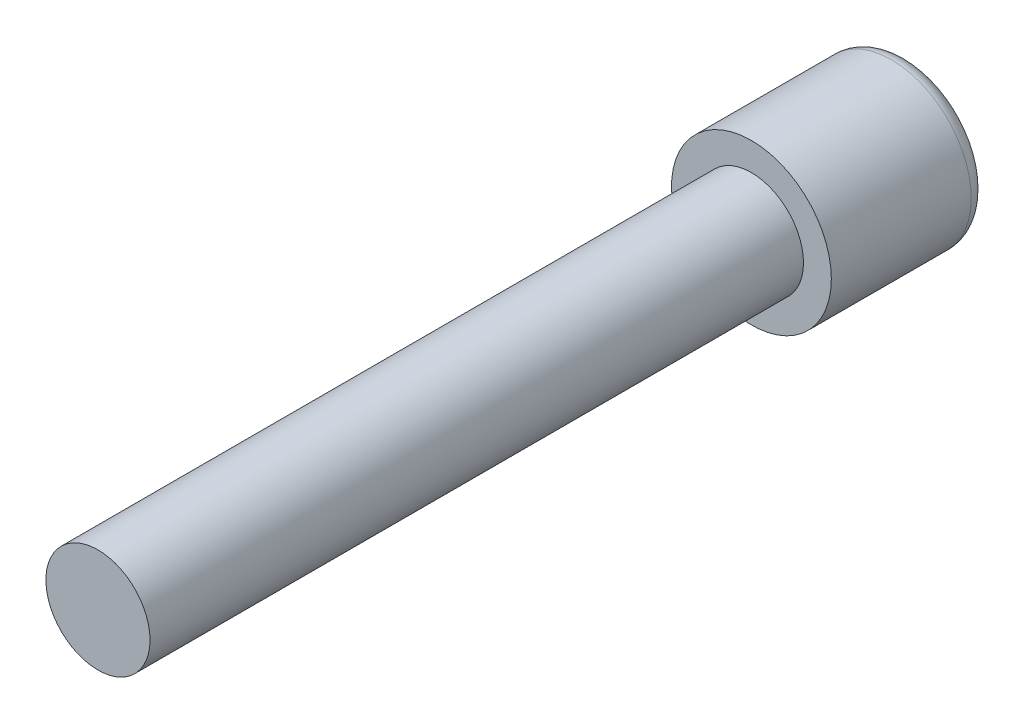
ISO-10303-21;
HEADER;
FILE_DESCRIPTION(('STEP AP214'),'2;1');
FILE_NAME('part.step','',(''),(''),'','','');
FILE_SCHEMA(('AUTOMOTIVE_DESIGN { 1 0 10303 214 1 1 1 1 }'));
ENDSEC;
DATA;
#1=APPLICATION_CONTEXT('core data for automotive mechanical design processes');
#2=APPLICATION_PROTOCOL_DEFINITION('international standard','automotive_design',2000,#1);
#3=PRODUCT_CONTEXT('',#1,'mechanical');
#4=PRODUCT('Part','Part','',(#3));
#5=PRODUCT_RELATED_PRODUCT_CATEGORY('part','',(#4));
#6=PRODUCT_DEFINITION_FORMATION('','',#4);
#7=PRODUCT_DEFINITION_CONTEXT('part definition',#1,'design');
#8=PRODUCT_DEFINITION('design','',#6,#7);
#9=PRODUCT_DEFINITION_SHAPE('','',#8);
#10=(LENGTH_UNIT() NAMED_UNIT(*) SI_UNIT(.MILLI.,.METRE.));
#11=(NAMED_UNIT(*) PLANE_ANGLE_UNIT() SI_UNIT($,.RADIAN.));
#12=(NAMED_UNIT(*) SI_UNIT($,.STERADIAN.) SOLID_ANGLE_UNIT());
#13=UNCERTAINTY_MEASURE_WITH_UNIT(LENGTH_MEASURE(1.E-05),#10,'distance_accuracy_value','');
#14=(GEOMETRIC_REPRESENTATION_CONTEXT(3) GLOBAL_UNCERTAINTY_ASSIGNED_CONTEXT((#13)) GLOBAL_UNIT_ASSIGNED_CONTEXT((#10,
#11,#12)) REPRESENTATION_CONTEXT('',''));
#15=CARTESIAN_POINT('',(0.,0.,0.));
#16=DIRECTION('',(0.,0.,1.));
#17=DIRECTION('',(1.,0.,0.));
#18=AXIS2_PLACEMENT_3D('',#15,#16,#17);
#19=CARTESIAN_POINT('',(0.,0.,-44.9891782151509));
#20=DIRECTION('',(0.,0.,1.));
#21=DIRECTION('',(1.,0.,0.));
#22=AXIS2_PLACEMENT_3D('',#19,#20,#21);
#23=CYLINDRICAL_SURFACE('',#22,2.54);
#24=CARTESIAN_POINT('',(0.,0.,-37.338));
#25=DIRECTION('',(0.,0.,1.));
#26=DIRECTION('',(1.,0.,0.));
#27=AXIS2_PLACEMENT_3D('',#24,#25,#26);
#28=CIRCLE('',#27,2.54);
#29=CARTESIAN_POINT('',(2.54,0.,-37.338));
#30=VERTEX_POINT('',#29);
#31=EDGE_CURVE('E90',#30,#30,#28,.F.);
#32=ORIENTED_EDGE('',*,*,#31,.F.);
#33=EDGE_LOOP('',(#32));
#34=FACE_BOUND('',#33,.T.);
#35=CARTESIAN_POINT('',(0.,0.,-5.461));
#36=DIRECTION('',(0.,0.,1.));
#37=DIRECTION('',(1.,0.,0.));
#38=AXIS2_PLACEMENT_3D('',#35,#36,#37);
#39=CIRCLE('',#38,2.54);
#40=CARTESIAN_POINT('',(2.54,0.,-5.461));
#41=VERTEX_POINT('',#40);
#42=EDGE_CURVE('E93',#41,#41,#39,.T.);
#43=ORIENTED_EDGE('',*,*,#42,.F.);
#44=EDGE_LOOP('',(#43));
#45=FACE_BOUND('',#44,.T.);
#46=ADVANCED_FACE('F40',(#34,#45),#23,.T.);
#47=CARTESIAN_POINT('',(0.,0.,-37.338));
#48=DIRECTION('',(0.,0.,1.));
#49=DIRECTION('',(1.,0.,0.));
#50=AXIS2_PLACEMENT_3D('',#47,#48,#49);
#51=PLANE('',#50);
#52=CARTESIAN_POINT('',(0.,0.,-37.338));
#53=DIRECTION('',(0.,0.,1.));
#54=DIRECTION('',(1.,0.,0.));
#55=AXIS2_PLACEMENT_3D('',#52,#53,#54);
#56=CIRCLE('',#55,3.8989);
#57=CARTESIAN_POINT('',(3.8989,0.,-37.338));
#58=VERTEX_POINT('',#57);
#59=EDGE_CURVE('E63',#58,#58,#56,.T.);
#60=ORIENTED_EDGE('',*,*,#59,.T.);
#61=EDGE_LOOP('',(#60));
#62=FACE_BOUND('',#61,.T.);
#63=ORIENTED_EDGE('',*,*,#31,.T.);
#64=EDGE_LOOP('',(#63));
#65=FACE_BOUND('',#64,.T.);
#66=ADVANCED_FACE('F100',(#62,#65),#51,.T.);
#67=CARTESIAN_POINT('',(0.,3.10515,-44.958));
#68=DIRECTION('',(0.,0.,-1.));
#69=DIRECTION('',(0.,1.,0.));
#70=AXIS2_PLACEMENT_3D('',#67,#68,#69);
#71=PLANE('',#70);
#72=CARTESIAN_POINT('',(0.,0.,-44.958));
#73=DIRECTION('',(0.,0.,1.));
#74=DIRECTION('',(0.,-1.,0.));
#75=AXIS2_PLACEMENT_3D('',#72,#73,#74);
#76=CIRCLE('',#75,3.10515);
#77=CARTESIAN_POINT('',(0.,-3.10514999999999,-44.958));
#78=VERTEX_POINT('',#77);
#79=CARTESIAN_POINT('',(0.,3.10515,-44.958));
#80=VERTEX_POINT('',#79);
#81=EDGE_CURVE('E58',#78,#80,#76,.T.);
#82=ORIENTED_EDGE('',*,*,#81,.F.);
#83=CARTESIAN_POINT('',(0.,0.,-44.958));
#84=DIRECTION('',(0.,0.,1.));
#85=DIRECTION('',(0.,1.,0.));
#86=AXIS2_PLACEMENT_3D('',#83,#84,#85);
#87=CIRCLE('',#86,3.10515);
#88=EDGE_CURVE('E52',#80,#78,#87,.T.);
#89=ORIENTED_EDGE('',*,*,#88,.F.);
#90=EDGE_LOOP('',(#82,#89));
#91=FACE_BOUND('',#90,.T.);
#92=ADVANCED_FACE('F42',(#91),#71,.T.);
#93=CARTESIAN_POINT('',(0.,0.,-44.16425));
#94=DIRECTION('',(0.,0.,-1.));
#95=DIRECTION('',(0.,1.,0.));
#96=AXIS2_PLACEMENT_3D('',#93,#94,#95);
#97=TOROIDAL_SURFACE('',#96,3.10515,0.793750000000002);
#98=CARTESIAN_POINT('',(0.,0.,-44.16425));
#99=DIRECTION('',(0.,0.,-1.));
#100=DIRECTION('',(0.,1.,0.));
#101=AXIS2_PLACEMENT_3D('',#98,#99,#100);
#102=CIRCLE('',#101,3.8989);
#103=CARTESIAN_POINT('',(0.,3.89890000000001,-44.16425));
#104=VERTEX_POINT('',#103);
#105=EDGE_CURVE('E11',#104,#104,#102,.F.);
#106=ORIENTED_EDGE('',*,*,#105,.F.);
#107=EDGE_LOOP('',(#106));
#108=FACE_BOUND('',#107,.T.);
#109=ORIENTED_EDGE('',*,*,#88,.T.);
#110=ORIENTED_EDGE('',*,*,#81,.T.);
#111=EDGE_LOOP('',(#109,#110));
#112=FACE_BOUND('',#111,.T.);
#113=ADVANCED_FACE('F66',(#108,#112),#97,.T.);
#114=CARTESIAN_POINT('',(0.,0.,-44.958));
#115=DIRECTION('',(0.,0.,-1.));
#116=DIRECTION('',(0.,1.,0.));
#117=AXIS2_PLACEMENT_3D('',#114,#115,#116);
#118=CYLINDRICAL_SURFACE('',#117,3.8989);
#119=ORIENTED_EDGE('',*,*,#105,.T.);
#120=EDGE_LOOP('',(#119));
#121=FACE_BOUND('',#120,.T.);
#122=ORIENTED_EDGE('',*,*,#59,.F.);
#123=EDGE_LOOP('',(#122));
#124=FACE_BOUND('',#123,.T.);
#125=ADVANCED_FACE('F82',(#121,#124),#118,.T.);
#126=CARTESIAN_POINT('',(0.,0.,-5.461));
#127=DIRECTION('',(0.,0.,1.));
#128=DIRECTION('',(1.,0.,0.));
#129=AXIS2_PLACEMENT_3D('',#126,#127,#128);
#130=PLANE('',#129);
#131=ORIENTED_EDGE('',*,*,#42,.T.);
#132=EDGE_LOOP('',(#131));
#133=FACE_BOUND('',#132,.T.);
#134=ADVANCED_FACE('F97',(#133),#130,.T.);
#135=CLOSED_SHELL('',(#46,#66,#92,#113,#125,#134));
#136=MANIFOLD_SOLID_BREP('B2',#135);
#137=ADVANCED_BREP_SHAPE_REPRESENTATION('',(#18,#136),#14);
#138=SHAPE_DEFINITION_REPRESENTATION(#9,#137);
ENDSEC;
END-ISO-10303-21;
